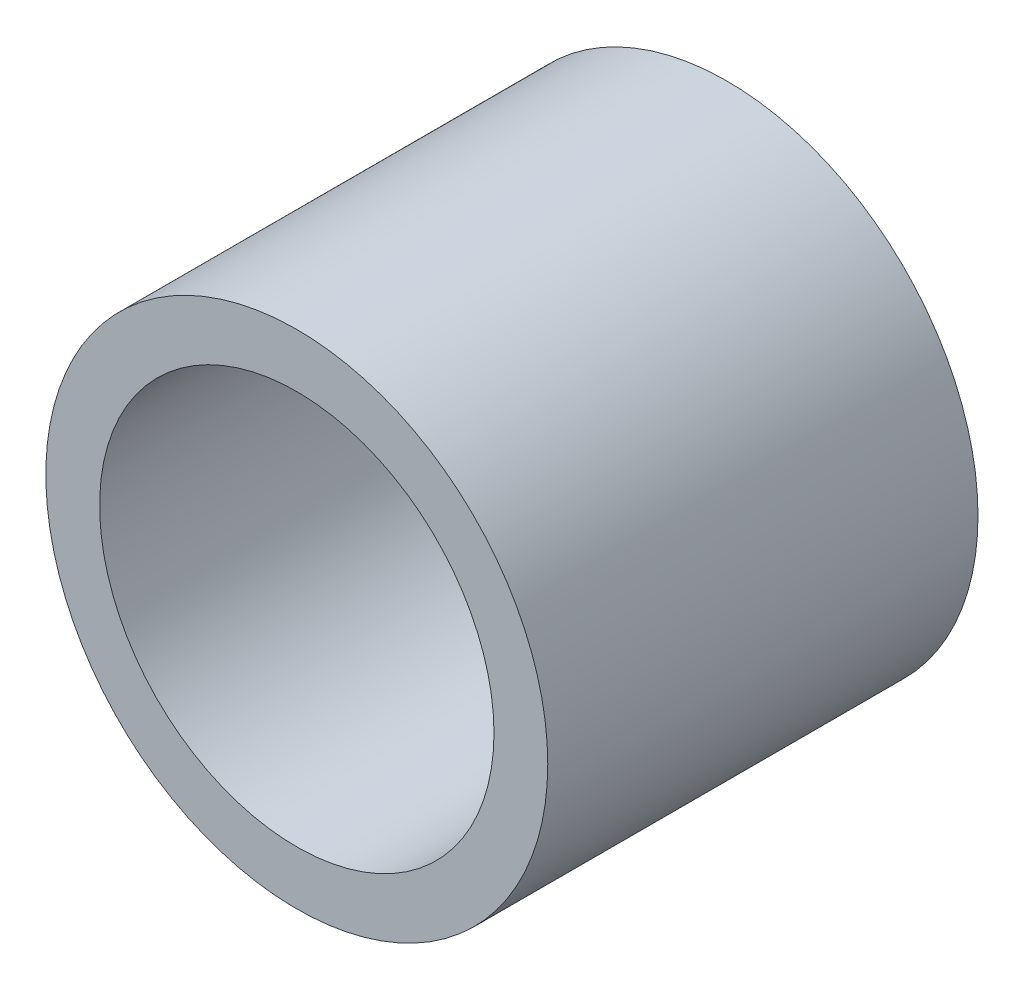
ISO-10303-21;
HEADER;
FILE_DESCRIPTION(('STEP AP214'),'2;1');
FILE_NAME('part.step','',(''),(''),'','','');
FILE_SCHEMA(('AUTOMOTIVE_DESIGN { 1 0 10303 214 1 1 1 1 }'));
ENDSEC;
DATA;
#1=APPLICATION_CONTEXT('core data for automotive mechanical design processes');
#2=APPLICATION_PROTOCOL_DEFINITION('international standard','automotive_design',2000,#1);
#3=PRODUCT_CONTEXT('',#1,'mechanical');
#4=PRODUCT('Part','Part','',(#3));
#5=PRODUCT_RELATED_PRODUCT_CATEGORY('part','',(#4));
#6=PRODUCT_DEFINITION_FORMATION('','',#4);
#7=PRODUCT_DEFINITION_CONTEXT('part definition',#1,'design');
#8=PRODUCT_DEFINITION('design','',#6,#7);
#9=PRODUCT_DEFINITION_SHAPE('','',#8);
#10=(LENGTH_UNIT() NAMED_UNIT(*) SI_UNIT(.MILLI.,.METRE.));
#11=(NAMED_UNIT(*) PLANE_ANGLE_UNIT() SI_UNIT($,.RADIAN.));
#12=(NAMED_UNIT(*) SI_UNIT($,.STERADIAN.) SOLID_ANGLE_UNIT());
#13=UNCERTAINTY_MEASURE_WITH_UNIT(LENGTH_MEASURE(1.E-05),#10,'distance_accuracy_value','');
#14=(GEOMETRIC_REPRESENTATION_CONTEXT(3) GLOBAL_UNCERTAINTY_ASSIGNED_CONTEXT((#13)) GLOBAL_UNIT_ASSIGNED_CONTEXT((#10,
#11,#12)) REPRESENTATION_CONTEXT('',''));
#15=CARTESIAN_POINT('',(0.,0.,0.));
#16=DIRECTION('',(0.,0.,1.));
#17=DIRECTION('',(1.,0.,0.));
#18=AXIS2_PLACEMENT_3D('',#15,#16,#17);
#19=CARTESIAN_POINT('',(0.,0.,-24.));
#20=DIRECTION('',(0.,0.,1.));
#21=DIRECTION('',(1.,0.,0.));
#22=AXIS2_PLACEMENT_3D('',#19,#20,#21);
#23=CYLINDRICAL_SURFACE('',#22,14.);
#24=CARTESIAN_POINT('',(0.,0.,-24.));
#25=DIRECTION('',(0.,0.,1.));
#26=DIRECTION('',(1.,0.,0.));
#27=AXIS2_PLACEMENT_3D('',#24,#25,#26);
#28=CIRCLE('',#27,14.);
#29=CARTESIAN_POINT('',(14.,0.,-24.));
#30=VERTEX_POINT('',#29);
#31=EDGE_CURVE('E10',#30,#30,#28,.T.);
#32=ORIENTED_EDGE('',*,*,#31,.T.);
#33=EDGE_LOOP('',(#32));
#34=FACE_BOUND('',#33,.T.);
#35=CARTESIAN_POINT('',(0.,0.,0.));
#36=DIRECTION('',(0.,0.,1.));
#37=DIRECTION('',(1.,0.,0.));
#38=AXIS2_PLACEMENT_3D('',#35,#36,#37);
#39=CIRCLE('',#38,14.);
#40=CARTESIAN_POINT('',(14.,0.,0.));
#41=VERTEX_POINT('',#40);
#42=EDGE_CURVE('E32',#41,#41,#39,.T.);
#43=ORIENTED_EDGE('',*,*,#42,.F.);
#44=EDGE_LOOP('',(#43));
#45=FACE_BOUND('',#44,.T.);
#46=ADVANCED_FACE('F26',(#34,#45),#23,.T.);
#47=CARTESIAN_POINT('',(0.,0.,-24.));
#48=DIRECTION('',(0.,0.,1.));
#49=DIRECTION('',(1.,0.,0.));
#50=AXIS2_PLACEMENT_3D('',#47,#48,#49);
#51=PLANE('',#50);
#52=CARTESIAN_POINT('',(0.,0.,-24.));
#53=DIRECTION('',(0.,0.,1.));
#54=DIRECTION('',(1.,0.,0.));
#55=AXIS2_PLACEMENT_3D('',#52,#53,#54);
#56=CIRCLE('',#55,11.);
#57=CARTESIAN_POINT('',(11.,0.,-24.));
#58=VERTEX_POINT('',#57);
#59=EDGE_CURVE('E36',#58,#58,#56,.T.);
#60=ORIENTED_EDGE('',*,*,#59,.T.);
#61=EDGE_LOOP('',(#60));
#62=FACE_BOUND('',#61,.T.);
#63=ORIENTED_EDGE('',*,*,#31,.F.);
#64=EDGE_LOOP('',(#63));
#65=FACE_BOUND('',#64,.T.);
#66=ADVANCED_FACE('F50',(#62,#65),#51,.F.);
#67=CARTESIAN_POINT('',(0.,0.,0.));
#68=DIRECTION('',(0.,0.,1.));
#69=DIRECTION('',(1.,0.,0.));
#70=AXIS2_PLACEMENT_3D('',#67,#68,#69);
#71=PLANE('',#70);
#72=CARTESIAN_POINT('',(0.,0.,0.));
#73=DIRECTION('',(0.,0.,1.));
#74=DIRECTION('',(1.,0.,0.));
#75=AXIS2_PLACEMENT_3D('',#72,#73,#74);
#76=CIRCLE('',#75,11.);
#77=CARTESIAN_POINT('',(11.,0.,0.));
#78=VERTEX_POINT('',#77);
#79=EDGE_CURVE('E40',#78,#78,#76,.T.);
#80=ORIENTED_EDGE('',*,*,#79,.F.);
#81=EDGE_LOOP('',(#80));
#82=FACE_BOUND('',#81,.T.);
#83=ORIENTED_EDGE('',*,*,#42,.T.);
#84=EDGE_LOOP('',(#83));
#85=FACE_BOUND('',#84,.T.);
#86=ADVANCED_FACE('F48',(#82,#85),#71,.T.);
#87=CARTESIAN_POINT('',(0.,0.,-24.));
#88=DIRECTION('',(0.,0.,1.));
#89=DIRECTION('',(1.,0.,0.));
#90=AXIS2_PLACEMENT_3D('',#87,#88,#89);
#91=CYLINDRICAL_SURFACE('',#90,11.);
#92=ORIENTED_EDGE('',*,*,#59,.F.);
#93=EDGE_LOOP('',(#92));
#94=FACE_BOUND('',#93,.T.);
#95=ORIENTED_EDGE('',*,*,#79,.T.);
#96=EDGE_LOOP('',(#95));
#97=FACE_BOUND('',#96,.T.);
#98=ADVANCED_FACE('F46',(#94,#97),#91,.F.);
#99=CLOSED_SHELL('',(#46,#66,#86,#98));
#100=MANIFOLD_SOLID_BREP('B2',#99);
#101=ADVANCED_BREP_SHAPE_REPRESENTATION('',(#18,#100),#14);
#102=SHAPE_DEFINITION_REPRESENTATION(#9,#101);
ENDSEC;
END-ISO-10303-21;
